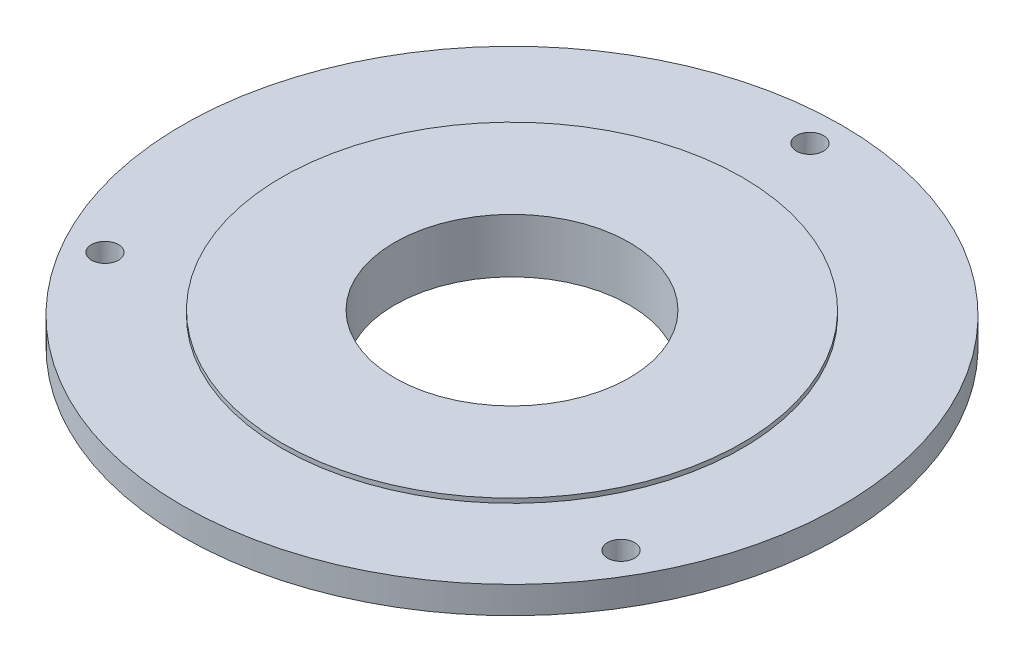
ISO-10303-21;
HEADER;
FILE_DESCRIPTION(('STEP AP214'),'2;1');
FILE_NAME('part.step','',(''),(''),'','','');
FILE_SCHEMA(('AUTOMOTIVE_DESIGN { 1 0 10303 214 1 1 1 1 }'));
ENDSEC;
DATA;
#1=APPLICATION_CONTEXT('core data for automotive mechanical design processes');
#2=APPLICATION_PROTOCOL_DEFINITION('international standard','automotive_design',2000,#1);
#3=PRODUCT_CONTEXT('',#1,'mechanical');
#4=PRODUCT('Part','Part','',(#3));
#5=PRODUCT_RELATED_PRODUCT_CATEGORY('part','',(#4));
#6=PRODUCT_DEFINITION_FORMATION('','',#4);
#7=PRODUCT_DEFINITION_CONTEXT('part definition',#1,'design');
#8=PRODUCT_DEFINITION('design','',#6,#7);
#9=PRODUCT_DEFINITION_SHAPE('','',#8);
#10=(LENGTH_UNIT() NAMED_UNIT(*) SI_UNIT(.MILLI.,.METRE.));
#11=(NAMED_UNIT(*) PLANE_ANGLE_UNIT() SI_UNIT($,.RADIAN.));
#12=(NAMED_UNIT(*) SI_UNIT($,.STERADIAN.) SOLID_ANGLE_UNIT());
#13=UNCERTAINTY_MEASURE_WITH_UNIT(LENGTH_MEASURE(1.E-05),#10,'distance_accuracy_value','');
#14=(GEOMETRIC_REPRESENTATION_CONTEXT(3) GLOBAL_UNCERTAINTY_ASSIGNED_CONTEXT((#13)) GLOBAL_UNIT_ASSIGNED_CONTEXT((#10,
#11,#12)) REPRESENTATION_CONTEXT('',''));
#15=CARTESIAN_POINT('',(0.,0.,0.));
#16=DIRECTION('',(0.,0.,1.));
#17=DIRECTION('',(1.,0.,0.));
#18=AXIS2_PLACEMENT_3D('',#15,#16,#17);
#19=CARTESIAN_POINT('',(0.,0.,0.));
#20=DIRECTION('',(0.,-1.,0.));
#21=DIRECTION('',(0.,0.,-1.));
#22=AXIS2_PLACEMENT_3D('',#19,#20,#21);
#23=CYLINDRICAL_SURFACE('',#22,25.5);
#24=CARTESIAN_POINT('',(0.,37.8859311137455,0.));
#25=DIRECTION('',(0.,-1.,0.));
#26=DIRECTION('',(0.,0.,-1.));
#27=AXIS2_PLACEMENT_3D('',#24,#25,#26);
#28=CIRCLE('',#27,25.5);
#29=CARTESIAN_POINT('',(0.,37.8859311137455,-25.5));
#30=VERTEX_POINT('',#29);
#31=EDGE_CURVE('E10',#30,#30,#28,.T.);
#32=ORIENTED_EDGE('',*,*,#31,.T.);
#33=EDGE_LOOP('',(#32));
#34=FACE_BOUND('',#33,.T.);
#35=CARTESIAN_POINT('',(0.,37.3859311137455,0.));
#36=DIRECTION('',(0.,-1.,0.));
#37=DIRECTION('',(0.,0.,-1.));
#38=AXIS2_PLACEMENT_3D('',#35,#36,#37);
#39=CIRCLE('',#38,25.5);
#40=CARTESIAN_POINT('',(0.,37.3859311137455,-25.5));
#41=VERTEX_POINT('',#40);
#42=EDGE_CURVE('E72',#41,#41,#39,.T.);
#43=ORIENTED_EDGE('',*,*,#42,.F.);
#44=EDGE_LOOP('',(#43));
#45=FACE_BOUND('',#44,.T.);
#46=ADVANCED_FACE('F37',(#34,#45),#23,.T.);
#47=CARTESIAN_POINT('',(13.,37.8859311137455,0.));
#48=DIRECTION('',(0.,1.,0.));
#49=DIRECTION('',(0.,0.,1.));
#50=AXIS2_PLACEMENT_3D('',#47,#48,#49);
#51=PLANE('',#50);
#52=CARTESIAN_POINT('',(0.,37.8859311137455,0.));
#53=DIRECTION('',(0.,-1.,0.));
#54=DIRECTION('',(0.,0.,-1.));
#55=AXIS2_PLACEMENT_3D('',#52,#53,#54);
#56=CIRCLE('',#55,13.);
#57=CARTESIAN_POINT('',(0.,37.8859311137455,-13.));
#58=VERTEX_POINT('',#57);
#59=EDGE_CURVE('E44',#58,#58,#56,.T.);
#60=ORIENTED_EDGE('',*,*,#59,.T.);
#61=EDGE_LOOP('',(#60));
#62=FACE_BOUND('',#61,.T.);
#63=ORIENTED_EDGE('',*,*,#31,.F.);
#64=EDGE_LOOP('',(#63));
#65=FACE_BOUND('',#64,.T.);
#66=ADVANCED_FACE('F144',(#62,#65),#51,.T.);
#67=CARTESIAN_POINT('',(0.,0.,0.));
#68=DIRECTION('',(0.,-1.,0.));
#69=DIRECTION('',(0.,0.,-1.));
#70=AXIS2_PLACEMENT_3D('',#67,#68,#69);
#71=CYLINDRICAL_SURFACE('',#70,13.);
#72=CARTESIAN_POINT('',(0.,31.8859311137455,0.));
#73=DIRECTION('',(0.,-1.,0.));
#74=DIRECTION('',(0.,0.,-1.));
#75=AXIS2_PLACEMENT_3D('',#72,#73,#74);
#76=CIRCLE('',#75,13.);
#77=CARTESIAN_POINT('',(0.,31.8859311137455,-13.));
#78=VERTEX_POINT('',#77);
#79=EDGE_CURVE('E49',#78,#78,#76,.T.);
#80=ORIENTED_EDGE('',*,*,#79,.T.);
#81=EDGE_LOOP('',(#80));
#82=FACE_BOUND('',#81,.T.);
#83=ORIENTED_EDGE('',*,*,#59,.F.);
#84=EDGE_LOOP('',(#83));
#85=FACE_BOUND('',#84,.T.);
#86=ADVANCED_FACE('F138',(#82,#85),#71,.F.);
#87=CARTESIAN_POINT('',(13.,31.8859311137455,0.));
#88=DIRECTION('',(0.,-1.,0.));
#89=DIRECTION('',(0.,0.,-1.));
#90=AXIS2_PLACEMENT_3D('',#87,#88,#89);
#91=PLANE('',#90);
#92=CARTESIAN_POINT('',(0.,31.8859311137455,0.));
#93=DIRECTION('',(0.,-1.,0.));
#94=DIRECTION('',(0.,0.,-1.));
#95=AXIS2_PLACEMENT_3D('',#92,#93,#94);
#96=CIRCLE('',#95,14.25);
#97=CARTESIAN_POINT('',(0.,31.8859311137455,-14.25));
#98=VERTEX_POINT('',#97);
#99=EDGE_CURVE('E54',#98,#98,#96,.T.);
#100=ORIENTED_EDGE('',*,*,#99,.T.);
#101=EDGE_LOOP('',(#100));
#102=FACE_BOUND('',#101,.T.);
#103=ORIENTED_EDGE('',*,*,#79,.F.);
#104=EDGE_LOOP('',(#103));
#105=FACE_BOUND('',#104,.T.);
#106=ADVANCED_FACE('F132',(#102,#105),#91,.T.);
#107=CARTESIAN_POINT('',(0.,0.,0.));
#108=DIRECTION('',(0.,-1.,0.));
#109=DIRECTION('',(0.,0.,-1.));
#110=AXIS2_PLACEMENT_3D('',#107,#108,#109);
#111=CYLINDRICAL_SURFACE('',#110,14.25);
#112=CARTESIAN_POINT('',(0.,34.3859311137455,0.));
#113=DIRECTION('',(0.,-1.,0.));
#114=DIRECTION('',(0.,0.,-1.));
#115=AXIS2_PLACEMENT_3D('',#112,#113,#114);
#116=CIRCLE('',#115,14.25);
#117=CARTESIAN_POINT('',(0.,34.3859311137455,-14.25));
#118=VERTEX_POINT('',#117);
#119=EDGE_CURVE('E60',#118,#118,#116,.T.);
#120=ORIENTED_EDGE('',*,*,#119,.T.);
#121=EDGE_LOOP('',(#120));
#122=FACE_BOUND('',#121,.T.);
#123=ORIENTED_EDGE('',*,*,#99,.F.);
#124=EDGE_LOOP('',(#123));
#125=FACE_BOUND('',#124,.T.);
#126=ADVANCED_FACE('F125',(#122,#125),#111,.T.);
#127=CARTESIAN_POINT('',(14.25,34.3859311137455,0.));
#128=DIRECTION('',(0.,-1.,0.));
#129=DIRECTION('',(0.,0.,-1.));
#130=AXIS2_PLACEMENT_3D('',#127,#128,#129);
#131=PLANE('',#130);
#132=CARTESIAN_POINT('',(0.,34.3859311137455,-33.));
#133=DIRECTION('',(0.,-1.,0.));
#134=DIRECTION('',(0.,0.,-1.));
#135=AXIS2_PLACEMENT_3D('',#132,#133,#134);
#136=CIRCLE('',#135,1.5);
#137=CARTESIAN_POINT('',(0.,34.3859311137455,-34.5));
#138=VERTEX_POINT('',#137);
#139=EDGE_CURVE('E76',#138,#138,#136,.T.);
#140=ORIENTED_EDGE('',*,*,#139,.F.);
#141=EDGE_LOOP('',(#140));
#142=FACE_BOUND('',#141,.T.);
#143=CARTESIAN_POINT('',(28.5788383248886,34.3859311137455,16.4999999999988));
#144=DIRECTION('',(0.,-1.,0.));
#145=DIRECTION('',(0.,0.,-1.));
#146=AXIS2_PLACEMENT_3D('',#143,#144,#145);
#147=CIRCLE('',#146,1.5000000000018);
#148=CARTESIAN_POINT('',(28.5788383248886,34.3859311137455,14.999999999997));
#149=VERTEX_POINT('',#148);
#150=EDGE_CURVE('E80',#149,#149,#147,.T.);
#151=ORIENTED_EDGE('',*,*,#150,.F.);
#152=EDGE_LOOP('',(#151));
#153=FACE_BOUND('',#152,.T.);
#154=CARTESIAN_POINT('',(-28.5788383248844,34.3859311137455,16.5000000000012));
#155=DIRECTION('',(0.,-1.,0.));
#156=DIRECTION('',(0.,0.,-1.));
#157=AXIS2_PLACEMENT_3D('',#154,#155,#156);
#158=CIRCLE('',#157,1.50000000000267);
#159=CARTESIAN_POINT('',(-28.5788383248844,34.3859311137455,14.9999999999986));
#160=VERTEX_POINT('',#159);
#161=EDGE_CURVE('E84',#160,#160,#158,.T.);
#162=ORIENTED_EDGE('',*,*,#161,.F.);
#163=EDGE_LOOP('',(#162));
#164=FACE_BOUND('',#163,.T.);
#165=CARTESIAN_POINT('',(0.,34.3859311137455,0.));
#166=DIRECTION('',(0.,-1.,0.));
#167=DIRECTION('',(0.,0.,-1.));
#168=AXIS2_PLACEMENT_3D('',#165,#166,#167);
#169=CIRCLE('',#168,36.5);
#170=CARTESIAN_POINT('',(0.,34.3859311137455,-36.5));
#171=VERTEX_POINT('',#170);
#172=EDGE_CURVE('E64',#171,#171,#169,.T.);
#173=ORIENTED_EDGE('',*,*,#172,.T.);
#174=EDGE_LOOP('',(#173));
#175=FACE_BOUND('',#174,.T.);
#176=ORIENTED_EDGE('',*,*,#119,.F.);
#177=EDGE_LOOP('',(#176));
#178=FACE_BOUND('',#177,.T.);
#179=ADVANCED_FACE('F119',(#142,#153,#164,#175,#178),#131,.T.);
#180=CARTESIAN_POINT('',(0.,0.,0.));
#181=DIRECTION('',(0.,-1.,0.));
#182=DIRECTION('',(0.,0.,-1.));
#183=AXIS2_PLACEMENT_3D('',#180,#181,#182);
#184=CYLINDRICAL_SURFACE('',#183,36.5);
#185=CARTESIAN_POINT('',(0.,37.3859311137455,0.));
#186=DIRECTION('',(0.,-1.,0.));
#187=DIRECTION('',(0.,0.,-1.));
#188=AXIS2_PLACEMENT_3D('',#185,#186,#187);
#189=CIRCLE('',#188,36.5);
#190=CARTESIAN_POINT('',(0.,37.3859311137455,-36.5));
#191=VERTEX_POINT('',#190);
#192=EDGE_CURVE('E68',#191,#191,#189,.T.);
#193=ORIENTED_EDGE('',*,*,#192,.T.);
#194=EDGE_LOOP('',(#193));
#195=FACE_BOUND('',#194,.T.);
#196=ORIENTED_EDGE('',*,*,#172,.F.);
#197=EDGE_LOOP('',(#196));
#198=FACE_BOUND('',#197,.T.);
#199=ADVANCED_FACE('F107',(#195,#198),#184,.T.);
#200=CARTESIAN_POINT('',(25.5,37.3859311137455,0.));
#201=DIRECTION('',(0.,1.,0.));
#202=DIRECTION('',(0.,0.,1.));
#203=AXIS2_PLACEMENT_3D('',#200,#201,#202);
#204=PLANE('',#203);
#205=CARTESIAN_POINT('',(0.,37.3859311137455,-33.));
#206=DIRECTION('',(0.,1.,0.));
#207=DIRECTION('',(0.,0.,1.));
#208=AXIS2_PLACEMENT_3D('',#205,#206,#207);
#209=CIRCLE('',#208,1.5);
#210=CARTESIAN_POINT('',(0.,37.3859311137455,-31.5));
#211=VERTEX_POINT('',#210);
#212=EDGE_CURVE('E88',#211,#211,#209,.T.);
#213=ORIENTED_EDGE('',*,*,#212,.F.);
#214=EDGE_LOOP('',(#213));
#215=FACE_BOUND('',#214,.T.);
#216=CARTESIAN_POINT('',(28.5788383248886,37.3859311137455,16.4999999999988));
#217=DIRECTION('',(0.,1.,0.));
#218=DIRECTION('',(0.,0.,1.));
#219=AXIS2_PLACEMENT_3D('',#216,#217,#218);
#220=CIRCLE('',#219,1.5000000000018);
#221=CARTESIAN_POINT('',(28.5788383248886,37.3859311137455,18.0000000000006));
#222=VERTEX_POINT('',#221);
#223=EDGE_CURVE('E93',#222,#222,#220,.T.);
#224=ORIENTED_EDGE('',*,*,#223,.F.);
#225=EDGE_LOOP('',(#224));
#226=FACE_BOUND('',#225,.T.);
#227=CARTESIAN_POINT('',(-28.5788383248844,37.3859311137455,16.5000000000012));
#228=DIRECTION('',(0.,1.,0.));
#229=DIRECTION('',(0.,0.,1.));
#230=AXIS2_PLACEMENT_3D('',#227,#228,#229);
#231=CIRCLE('',#230,1.50000000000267);
#232=CARTESIAN_POINT('',(-28.5788383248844,37.3859311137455,18.0000000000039));
#233=VERTEX_POINT('',#232);
#234=EDGE_CURVE('E89',#233,#233,#231,.T.);
#235=ORIENTED_EDGE('',*,*,#234,.F.);
#236=EDGE_LOOP('',(#235));
#237=FACE_BOUND('',#236,.T.);
#238=ORIENTED_EDGE('',*,*,#42,.T.);
#239=EDGE_LOOP('',(#238));
#240=FACE_BOUND('',#239,.T.);
#241=ORIENTED_EDGE('',*,*,#192,.F.);
#242=EDGE_LOOP('',(#241));
#243=FACE_BOUND('',#242,.T.);
#244=ADVANCED_FACE('F103',(#215,#226,#237,#240,#243),#204,.T.);
#245=CARTESIAN_POINT('',(-28.5788383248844,31.8859311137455,16.5000000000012));
#246=DIRECTION('',(0.,1.,0.));
#247=DIRECTION('',(0.,0.,1.));
#248=AXIS2_PLACEMENT_3D('',#245,#246,#247);
#249=CYLINDRICAL_SURFACE('',#248,1.50000000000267);
#250=ORIENTED_EDGE('',*,*,#161,.T.);
#251=EDGE_LOOP('',(#250));
#252=FACE_BOUND('',#251,.T.);
#253=ORIENTED_EDGE('',*,*,#234,.T.);
#254=EDGE_LOOP('',(#253));
#255=FACE_BOUND('',#254,.T.);
#256=ADVANCED_FACE('F106',(#252,#255),#249,.F.);
#257=CARTESIAN_POINT('',(28.5788383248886,31.8859311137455,16.4999999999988));
#258=DIRECTION('',(0.,1.,0.));
#259=DIRECTION('',(0.,0.,1.));
#260=AXIS2_PLACEMENT_3D('',#257,#258,#259);
#261=CYLINDRICAL_SURFACE('',#260,1.5000000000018);
#262=ORIENTED_EDGE('',*,*,#150,.T.);
#263=EDGE_LOOP('',(#262));
#264=FACE_BOUND('',#263,.T.);
#265=ORIENTED_EDGE('',*,*,#223,.T.);
#266=EDGE_LOOP('',(#265));
#267=FACE_BOUND('',#266,.T.);
#268=ADVANCED_FACE('F200',(#264,#267),#261,.F.);
#269=CARTESIAN_POINT('',(0.,31.8859311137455,-33.));
#270=DIRECTION('',(0.,1.,0.));
#271=DIRECTION('',(0.,0.,1.));
#272=AXIS2_PLACEMENT_3D('',#269,#270,#271);
#273=CYLINDRICAL_SURFACE('',#272,1.5);
#274=ORIENTED_EDGE('',*,*,#139,.T.);
#275=EDGE_LOOP('',(#274));
#276=FACE_BOUND('',#275,.T.);
#277=ORIENTED_EDGE('',*,*,#212,.T.);
#278=EDGE_LOOP('',(#277));
#279=FACE_BOUND('',#278,.T.);
#280=ADVANCED_FACE('F101',(#276,#279),#273,.F.);
#281=CLOSED_SHELL('',(#46,#66,#86,#106,#126,#179,#199,#244,#256,#268,#280));
#282=MANIFOLD_SOLID_BREP('B2',#281);
#283=ADVANCED_BREP_SHAPE_REPRESENTATION('',(#18,#282),#14);
#284=SHAPE_DEFINITION_REPRESENTATION(#9,#283);
ENDSEC;
END-ISO-10303-21;
